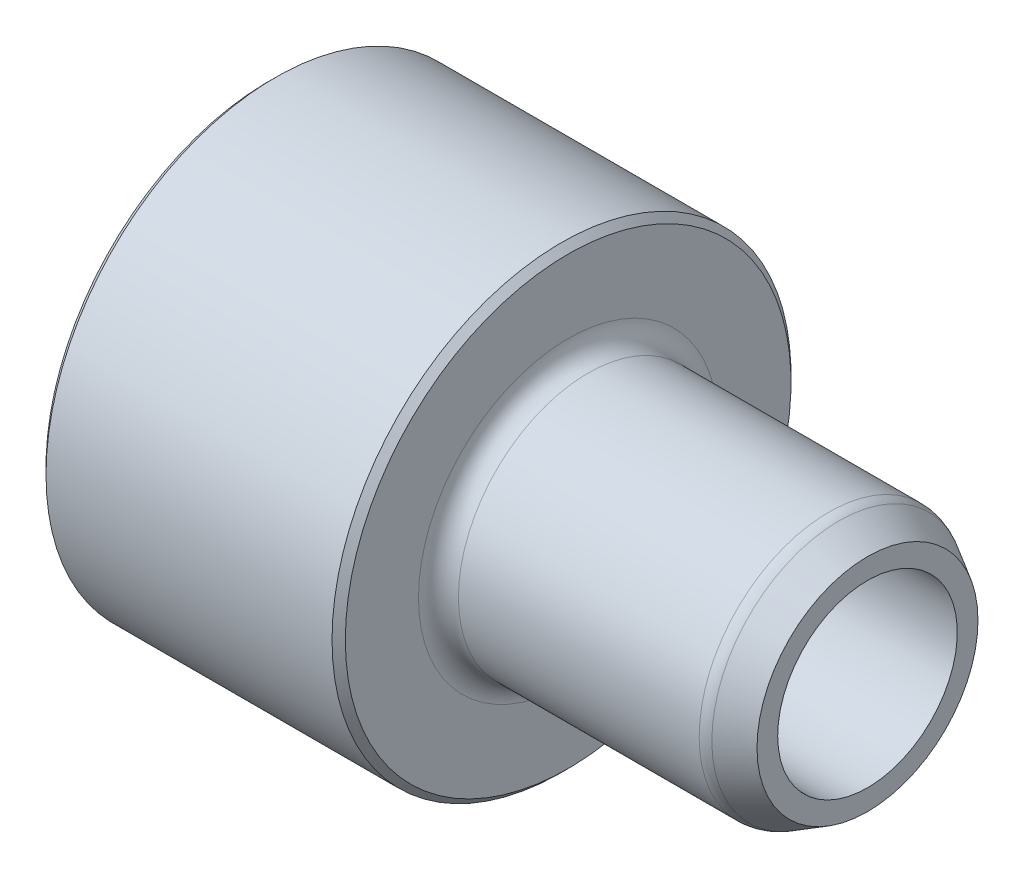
from build123d import *

# Parameters (mm, degrees)
CONG_1_R        = 0.3
CHANFREIN1_SIZE = 0.1


with BuildPart() as part:
    # Esquisse1 → R_volution1 (revolve)
    with BuildSketch(Plane.XY, mode=Mode.PRIVATE) as r_volution1_sk:
        Polygon((0.25, 1.35), (5.75, 1.35), (5.75, 1.661324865), (5.25, 1.95), (1.25, 1.95), (1.25, 3.45), (-3.25, 3.45), (-3.25, 2.5), (0.25, 2.5), align=None)
    revolve(r_volution1_sk.sketch.rotate(Axis((0, 0, 0), (1, 0, 0)), 90), axis=Axis((0, 0, 0), (1, 0, 0)))

    # Cong_1
    cong_1_edges = [part.edges().sort_by_distance(p)[0] for p in [
        (5.25, 0, -1.95),
        (1.25, 0, -1.95),
    ]]
    fillet(cong_1_edges, radius=CONG_1_R)

    # Chanfrein1
    chanfrein1_edges = [part.edges().sort_by_distance(p)[0] for p in [
        (1.25, 0, -3.45),
        (-3.25, 0, -3.45),
        (-3.25, 0, -2.5),
    ]]
    chamfer(chanfrein1_edges, length=CHANFREIN1_SIZE)


solid = part.part
